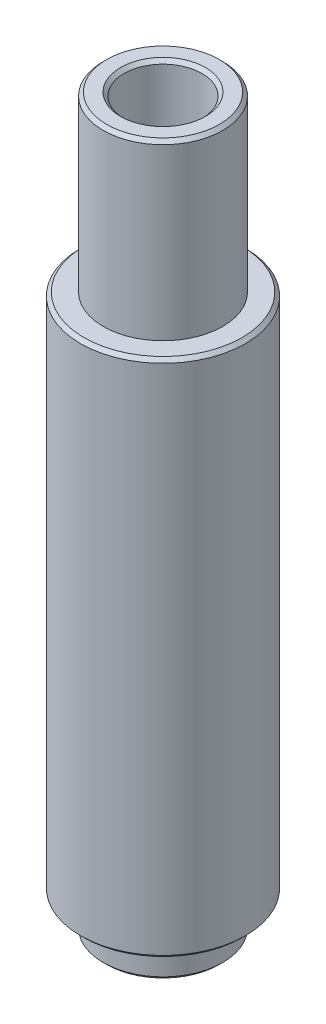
from build123d import *

# Parameters (mm, degrees)
CHAMFER1_SIZE = 0.2


with BuildPart() as part:
    # Sketch1 → Revolve1 (revolve)
    with BuildSketch(Plane.XY):
        Polygon((2.25, 0), (2.25, 42), (3.45, 42), (3.45, 32), (4.7625, 32), (4.7625, 2), (3.45, 2), (3.45, 0), align=None)
    revolve(axis=Axis((0, -1000, 0), (0, 1, 0)))

    # Chamfer1
    chamfer1_edges = [part.edges().sort_by_distance(p)[0] for p in [
        (-2.25, 0, 0),
        (-3.45, 0, 0),
        (-4.7625, 2, 0),
        (-4.7625, 32, 0),
        (-3.45, 42, 0),
        (-2.25, 42, 0),
    ]]
    chamfer(chamfer1_edges, length=CHAMFER1_SIZE)


solid = part.part
